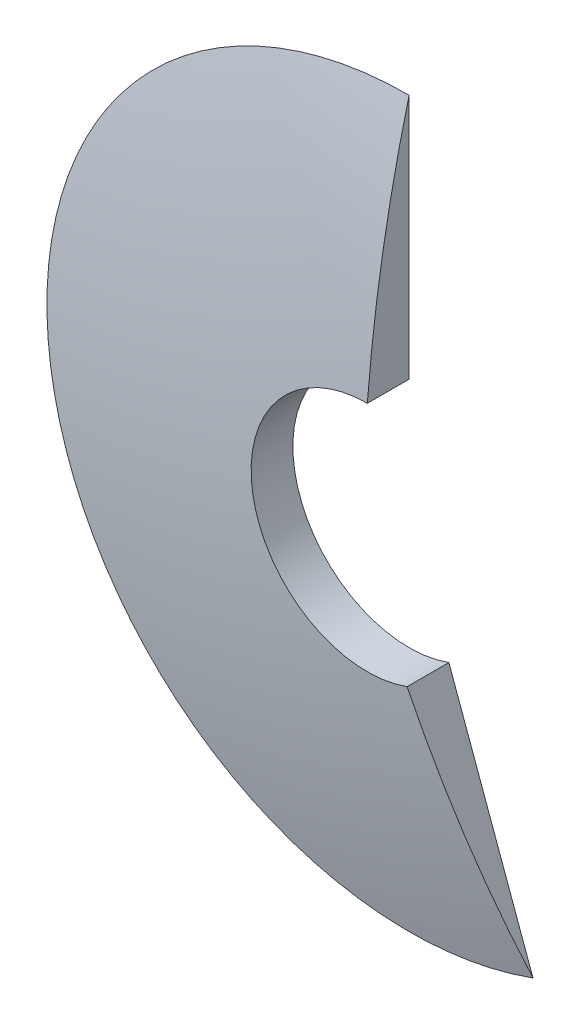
ISO-10303-21;
HEADER;
FILE_DESCRIPTION(('STEP AP214'),'2;1');
FILE_NAME('part.step','',(''),(''),'','','');
FILE_SCHEMA(('AUTOMOTIVE_DESIGN { 1 0 10303 214 1 1 1 1 }'));
ENDSEC;
DATA;
#1=APPLICATION_CONTEXT('core data for automotive mechanical design processes');
#2=APPLICATION_PROTOCOL_DEFINITION('international standard','automotive_design',2000,#1);
#3=PRODUCT_CONTEXT('',#1,'mechanical');
#4=PRODUCT('Part','Part','',(#3));
#5=PRODUCT_RELATED_PRODUCT_CATEGORY('part','',(#4));
#6=PRODUCT_DEFINITION_FORMATION('','',#4);
#7=PRODUCT_DEFINITION_CONTEXT('part definition',#1,'design');
#8=PRODUCT_DEFINITION('design','',#6,#7);
#9=PRODUCT_DEFINITION_SHAPE('','',#8);
#10=(LENGTH_UNIT() NAMED_UNIT(*) SI_UNIT(.MILLI.,.METRE.));
#11=(NAMED_UNIT(*) PLANE_ANGLE_UNIT() SI_UNIT($,.RADIAN.));
#12=(NAMED_UNIT(*) SI_UNIT($,.STERADIAN.) SOLID_ANGLE_UNIT());
#13=UNCERTAINTY_MEASURE_WITH_UNIT(LENGTH_MEASURE(1.E-05),#10,'distance_accuracy_value','');
#14=(GEOMETRIC_REPRESENTATION_CONTEXT(3) GLOBAL_UNCERTAINTY_ASSIGNED_CONTEXT((#13)) GLOBAL_UNIT_ASSIGNED_CONTEXT((#10,
#11,#12)) REPRESENTATION_CONTEXT('',''));
#15=CARTESIAN_POINT('',(0.,0.,0.));
#16=DIRECTION('',(0.,0.,1.));
#17=DIRECTION('',(1.,0.,0.));
#18=AXIS2_PLACEMENT_3D('',#15,#16,#17);
#19=CARTESIAN_POINT('',(0.,0.,0.));
#20=DIRECTION('',(0.,0.,1.));
#21=DIRECTION('',(1.,0.,0.));
#22=AXIS2_PLACEMENT_3D('',#19,#20,#21);
#23=PLANE('',#22);
#24=DIRECTION('',(0.342020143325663,-0.939692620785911,0.));
#25=VECTOR('',#24,1.);
#26=CARTESIAN_POINT('',(0.,0.,0.));
#27=LINE('',#26,#25);
#28=CARTESIAN_POINT('',(5.60057984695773,-15.3874666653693,0.));
#29=VERTEX_POINT('',#28);
#30=CARTESIAN_POINT('',(17.4514068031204,-47.947346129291,0.));
#31=VERTEX_POINT('',#30);
#32=EDGE_CURVE('E65',#29,#31,#27,.T.);
#33=ORIENTED_EDGE('',*,*,#32,.T.);
#34=CARTESIAN_POINT('',(0.,0.,0.));
#35=DIRECTION('',(0.,0.,-1.));
#36=DIRECTION('',(-1.,0.,0.));
#37=AXIS2_PLACEMENT_3D('',#34,#35,#36);
#38=CIRCLE('',#37,51.0245);
#39=CARTESIAN_POINT('',(0.,51.0245,0.));
#40=VERTEX_POINT('',#39);
#41=EDGE_CURVE('E80',#31,#40,#38,.T.);
#42=ORIENTED_EDGE('',*,*,#41,.T.);
#43=DIRECTION('',(0.,1.,0.));
#44=VECTOR('',#43,1.);
#45=CARTESIAN_POINT('',(0.,0.,0.));
#46=LINE('',#45,#44);
#47=CARTESIAN_POINT('',(0.,16.375,0.));
#48=VERTEX_POINT('',#47);
#49=EDGE_CURVE('E48',#48,#40,#46,.T.);
#50=ORIENTED_EDGE('',*,*,#49,.F.);
#51=CARTESIAN_POINT('',(0.,0.,0.));
#52=DIRECTION('',(0.,0.,1.));
#53=DIRECTION('',(1.,0.,0.));
#54=AXIS2_PLACEMENT_3D('',#51,#52,#53);
#55=CIRCLE('',#54,16.375);
#56=EDGE_CURVE('E77',#48,#29,#55,.T.);
#57=ORIENTED_EDGE('',*,*,#56,.T.);
#58=EDGE_LOOP('',(#33,#42,#50,#57));
#59=FACE_BOUND('',#58,.T.);
#60=ADVANCED_FACE('F34',(#59),#23,.F.);
#61=CARTESIAN_POINT('',(0.,0.,6.55));
#62=DIRECTION('',(0.,0.,-1.));
#63=DIRECTION('',(-1.,0.,0.));
#64=AXIS2_PLACEMENT_3D('',#61,#62,#63);
#65=CYLINDRICAL_SURFACE('',#64,16.375);
#66=CARTESIAN_POINT('',(0.,0.,5.88524253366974));
#67=DIRECTION('',(0.,0.,-1.));
#68=DIRECTION('',(-1.,0.,0.));
#69=AXIS2_PLACEMENT_3D('',#66,#67,#68);
#70=CIRCLE('',#69,16.375);
#71=CARTESIAN_POINT('',(5.60057984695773,-15.3874666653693,5.88524253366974));
#72=VERTEX_POINT('',#71);
#73=CARTESIAN_POINT('',(0.,16.3750000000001,5.88524253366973));
#74=VERTEX_POINT('',#73);
#75=EDGE_CURVE('E79',#72,#74,#70,.T.);
#76=ORIENTED_EDGE('',*,*,#75,.F.);
#77=DIRECTION('',(0.,0.,-1.));
#78=VECTOR('',#77,1.);
#79=CARTESIAN_POINT('',(5.60057984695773,-15.3874666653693,6.55));
#80=LINE('',#79,#78);
#81=EDGE_CURVE('E55',#72,#29,#80,.T.);
#82=ORIENTED_EDGE('',*,*,#81,.T.);
#83=ORIENTED_EDGE('',*,*,#56,.F.);
#84=DIRECTION('',(0.,0.,-1.));
#85=VECTOR('',#84,1.);
#86=CARTESIAN_POINT('',(0.,16.375,6.55));
#87=LINE('',#86,#85);
#88=EDGE_CURVE('E81',#74,#48,#87,.T.);
#89=ORIENTED_EDGE('',*,*,#88,.F.);
#90=EDGE_LOOP('',(#76,#82,#83,#89));
#91=FACE_BOUND('',#90,.T.);
#92=ADVANCED_FACE('F75',(#91),#65,.F.);
#93=CARTESIAN_POINT('',(0.,0.,-195.465427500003));
#94=DIRECTION('',(0.,0.,-1.));
#95=DIRECTION('',(0.,1.,0.));
#96=AXIS2_PLACEMENT_3D('',#93,#94,#95);
#97=SPHERICAL_SURFACE('',#96,202.015427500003);
#98=CARTESIAN_POINT('',(0.,0.,-195.465427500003));
#99=DIRECTION('',(0.93969262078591,0.342020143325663,0.));
#100=DIRECTION('',(-0.342020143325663,0.939692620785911,0.));
#101=AXIS2_PLACEMENT_3D('',#98,#99,#100);
#102=CIRCLE('',#101,202.015427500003);
#103=EDGE_CURVE('E11',#72,#31,#102,.T.);
#104=ORIENTED_EDGE('',*,*,#103,.F.);
#105=ORIENTED_EDGE('',*,*,#75,.T.);
#106=CARTESIAN_POINT('',(0.,0.,-195.465427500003));
#107=DIRECTION('',(-1.,0.,0.));
#108=DIRECTION('',(0.,0.,1.));
#109=AXIS2_PLACEMENT_3D('',#106,#107,#108);
#110=CIRCLE('',#109,202.015427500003);
#111=EDGE_CURVE('E41',#74,#40,#110,.T.);
#112=ORIENTED_EDGE('',*,*,#111,.T.);
#113=ORIENTED_EDGE('',*,*,#41,.F.);
#114=EDGE_LOOP('',(#104,#105,#112,#113));
#115=FACE_BOUND('',#114,.T.);
#116=ADVANCED_FACE('F90',(#115),#97,.T.);
#117=CARTESIAN_POINT('',(0.,0.,5.88524253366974));
#118=DIRECTION('',(-1.,0.,0.));
#119=DIRECTION('',(0.,0.,1.));
#120=AXIS2_PLACEMENT_3D('',#117,#118,#119);
#121=PLANE('',#120);
#122=ORIENTED_EDGE('',*,*,#88,.T.);
#123=ORIENTED_EDGE('',*,*,#49,.T.);
#124=ORIENTED_EDGE('',*,*,#111,.F.);
#125=EDGE_LOOP('',(#122,#123,#124));
#126=FACE_BOUND('',#125,.T.);
#127=ADVANCED_FACE('F88',(#126),#121,.F.);
#128=CARTESIAN_POINT('',(0.,0.,5.88524253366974));
#129=DIRECTION('',(0.93969262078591,0.342020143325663,0.));
#130=DIRECTION('',(-0.342020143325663,0.939692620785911,0.));
#131=AXIS2_PLACEMENT_3D('',#128,#129,#130);
#132=PLANE('',#131);
#133=ORIENTED_EDGE('',*,*,#103,.T.);
#134=ORIENTED_EDGE('',*,*,#32,.F.);
#135=ORIENTED_EDGE('',*,*,#81,.F.);
#136=EDGE_LOOP('',(#133,#134,#135));
#137=FACE_BOUND('',#136,.T.);
#138=ADVANCED_FACE('F66',(#137),#132,.T.);
#139=CLOSED_SHELL('',(#60,#92,#116,#127,#138));
#140=MANIFOLD_SOLID_BREP('B2',#139);
#141=ADVANCED_BREP_SHAPE_REPRESENTATION('',(#18,#140),#14);
#142=SHAPE_DEFINITION_REPRESENTATION(#9,#141);
ENDSEC;
END-ISO-10303-21;
